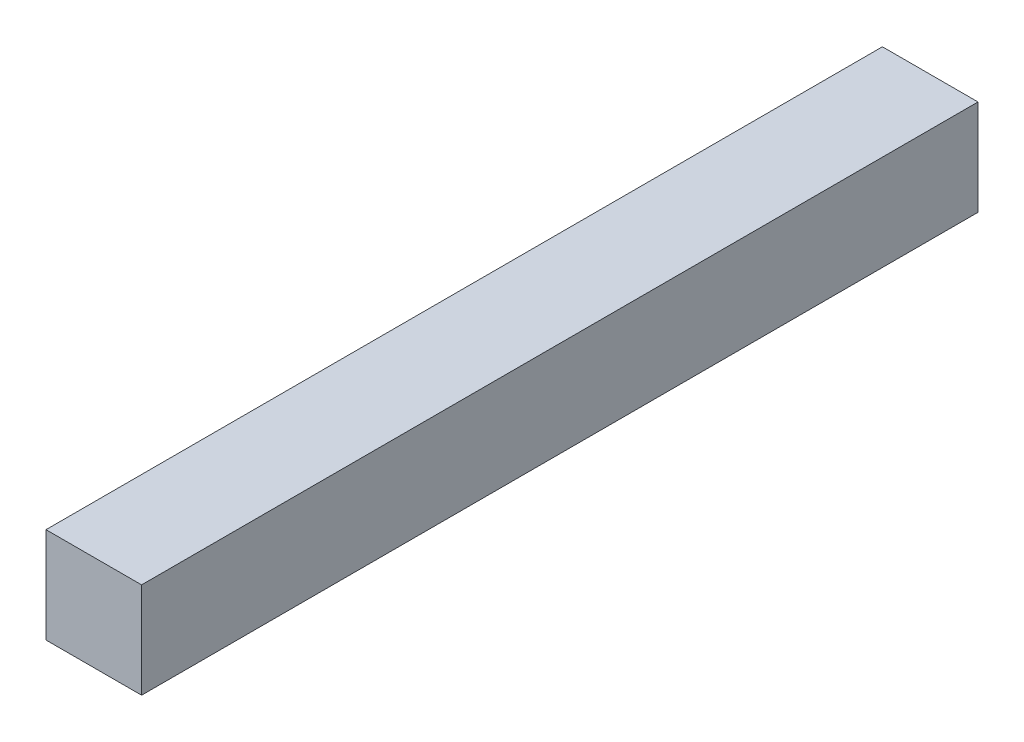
ISO-10303-21;
HEADER;
FILE_DESCRIPTION(('STEP AP214'),'2;1');
FILE_NAME('part.step','',(''),(''),'','','');
FILE_SCHEMA(('AUTOMOTIVE_DESIGN { 1 0 10303 214 1 1 1 1 }'));
ENDSEC;
DATA;
#1=APPLICATION_CONTEXT('core data for automotive mechanical design processes');
#2=APPLICATION_PROTOCOL_DEFINITION('international standard','automotive_design',2000,#1);
#3=PRODUCT_CONTEXT('',#1,'mechanical');
#4=PRODUCT('Part','Part','',(#3));
#5=PRODUCT_RELATED_PRODUCT_CATEGORY('part','',(#4));
#6=PRODUCT_DEFINITION_FORMATION('','',#4);
#7=PRODUCT_DEFINITION_CONTEXT('part definition',#1,'design');
#8=PRODUCT_DEFINITION('design','',#6,#7);
#9=PRODUCT_DEFINITION_SHAPE('','',#8);
#10=(LENGTH_UNIT() NAMED_UNIT(*) SI_UNIT(.MILLI.,.METRE.));
#11=(NAMED_UNIT(*) PLANE_ANGLE_UNIT() SI_UNIT($,.RADIAN.));
#12=(NAMED_UNIT(*) SI_UNIT($,.STERADIAN.) SOLID_ANGLE_UNIT());
#13=UNCERTAINTY_MEASURE_WITH_UNIT(LENGTH_MEASURE(1.E-05),#10,'distance_accuracy_value','');
#14=(GEOMETRIC_REPRESENTATION_CONTEXT(3) GLOBAL_UNCERTAINTY_ASSIGNED_CONTEXT((#13)) GLOBAL_UNIT_ASSIGNED_CONTEXT((#10,
#11,#12)) REPRESENTATION_CONTEXT('',''));
#15=CARTESIAN_POINT('',(0.,0.,0.));
#16=DIRECTION('',(0.,0.,1.));
#17=DIRECTION('',(1.,0.,0.));
#18=AXIS2_PLACEMENT_3D('',#15,#16,#17);
#19=CARTESIAN_POINT('',(-40.,40.,350.));
#20=DIRECTION('',(1.,0.,0.));
#21=DIRECTION('',(0.,1.,0.));
#22=AXIS2_PLACEMENT_3D('',#19,#20,#21);
#23=PLANE('',#22);
#24=DIRECTION('',(0.,-1.,0.));
#25=VECTOR('',#24,1.);
#26=CARTESIAN_POINT('',(-40.,40.,-350.));
#27=LINE('',#26,#25);
#28=CARTESIAN_POINT('',(-40.,40.,-350.));
#29=VERTEX_POINT('',#28);
#30=CARTESIAN_POINT('',(-40.,-40.,-350.));
#31=VERTEX_POINT('',#30);
#32=EDGE_CURVE('E96',#29,#31,#27,.T.);
#33=ORIENTED_EDGE('',*,*,#32,.T.);
#34=DIRECTION('',(0.,0.,-1.));
#35=VECTOR('',#34,1.);
#36=CARTESIAN_POINT('',(-40.,-40.,350.));
#37=LINE('',#36,#35);
#38=CARTESIAN_POINT('',(-40.,-40.,350.));
#39=VERTEX_POINT('',#38);
#40=EDGE_CURVE('E11',#39,#31,#37,.T.);
#41=ORIENTED_EDGE('',*,*,#40,.F.);
#42=DIRECTION('',(0.,-1.,0.));
#43=VECTOR('',#42,1.);
#44=CARTESIAN_POINT('',(-40.,40.,350.));
#45=LINE('',#44,#43);
#46=CARTESIAN_POINT('',(-40.,40.,350.));
#47=VERTEX_POINT('',#46);
#48=EDGE_CURVE('E84',#47,#39,#45,.T.);
#49=ORIENTED_EDGE('',*,*,#48,.F.);
#50=DIRECTION('',(0.,0.,-1.));
#51=VECTOR('',#50,1.);
#52=CARTESIAN_POINT('',(-40.,40.,350.));
#53=LINE('',#52,#51);
#54=EDGE_CURVE('E92',#47,#29,#53,.T.);
#55=ORIENTED_EDGE('',*,*,#54,.T.);
#56=EDGE_LOOP('',(#33,#41,#49,#55));
#57=FACE_BOUND('',#56,.T.);
#58=ADVANCED_FACE('F33',(#57),#23,.F.);
#59=CARTESIAN_POINT('',(40.,-40.,350.));
#60=DIRECTION('',(0.,1.,0.));
#61=DIRECTION('',(-1.,0.,0.));
#62=AXIS2_PLACEMENT_3D('',#59,#60,#61);
#63=PLANE('',#62);
#64=DIRECTION('',(1.,0.,0.));
#65=VECTOR('',#64,1.);
#66=CARTESIAN_POINT('',(40.,-40.,-350.));
#67=LINE('',#66,#65);
#68=CARTESIAN_POINT('',(40.,-40.,-350.));
#69=VERTEX_POINT('',#68);
#70=EDGE_CURVE('E88',#31,#69,#67,.T.);
#71=ORIENTED_EDGE('',*,*,#70,.T.);
#72=DIRECTION('',(0.,0.,-1.));
#73=VECTOR('',#72,1.);
#74=CARTESIAN_POINT('',(40.,-40.,350.));
#75=LINE('',#74,#73);
#76=CARTESIAN_POINT('',(40.,-40.,350.));
#77=VERTEX_POINT('',#76);
#78=EDGE_CURVE('E41',#77,#69,#75,.T.);
#79=ORIENTED_EDGE('',*,*,#78,.F.);
#80=DIRECTION('',(1.,0.,0.));
#81=VECTOR('',#80,1.);
#82=CARTESIAN_POINT('',(40.,-40.,350.));
#83=LINE('',#82,#81);
#84=EDGE_CURVE('E79',#39,#77,#83,.T.);
#85=ORIENTED_EDGE('',*,*,#84,.F.);
#86=ORIENTED_EDGE('',*,*,#40,.T.);
#87=EDGE_LOOP('',(#71,#79,#85,#86));
#88=FACE_BOUND('',#87,.T.);
#89=ADVANCED_FACE('F87',(#88),#63,.F.);
#90=CARTESIAN_POINT('',(40.,40.,350.));
#91=DIRECTION('',(-1.,0.,0.));
#92=DIRECTION('',(0.,-1.,0.));
#93=AXIS2_PLACEMENT_3D('',#90,#91,#92);
#94=PLANE('',#93);
#95=DIRECTION('',(0.,1.,0.));
#96=VECTOR('',#95,1.);
#97=CARTESIAN_POINT('',(40.,40.,-350.));
#98=LINE('',#97,#96);
#99=CARTESIAN_POINT('',(40.,40.,-350.));
#100=VERTEX_POINT('',#99);
#101=EDGE_CURVE('E66',#69,#100,#98,.T.);
#102=ORIENTED_EDGE('',*,*,#101,.T.);
#103=DIRECTION('',(0.,0.,-1.));
#104=VECTOR('',#103,1.);
#105=CARTESIAN_POINT('',(40.,40.,350.));
#106=LINE('',#105,#104);
#107=CARTESIAN_POINT('',(40.,40.,350.));
#108=VERTEX_POINT('',#107);
#109=EDGE_CURVE('E89',#108,#100,#106,.T.);
#110=ORIENTED_EDGE('',*,*,#109,.F.);
#111=DIRECTION('',(0.,1.,0.));
#112=VECTOR('',#111,1.);
#113=CARTESIAN_POINT('',(40.,40.,350.));
#114=LINE('',#113,#112);
#115=EDGE_CURVE('E82',#77,#108,#114,.T.);
#116=ORIENTED_EDGE('',*,*,#115,.F.);
#117=ORIENTED_EDGE('',*,*,#78,.T.);
#118=EDGE_LOOP('',(#102,#110,#116,#117));
#119=FACE_BOUND('',#118,.T.);
#120=ADVANCED_FACE('F90',(#119),#94,.F.);
#121=CARTESIAN_POINT('',(40.,40.,350.));
#122=DIRECTION('',(0.,-1.,0.));
#123=DIRECTION('',(1.,0.,0.));
#124=AXIS2_PLACEMENT_3D('',#121,#122,#123);
#125=PLANE('',#124);
#126=DIRECTION('',(-1.,0.,0.));
#127=VECTOR('',#126,1.);
#128=CARTESIAN_POINT('',(40.,40.,-350.));
#129=LINE('',#128,#127);
#130=EDGE_CURVE('E72',#100,#29,#129,.T.);
#131=ORIENTED_EDGE('',*,*,#130,.T.);
#132=ORIENTED_EDGE('',*,*,#54,.F.);
#133=DIRECTION('',(-1.,0.,0.));
#134=VECTOR('',#133,1.);
#135=CARTESIAN_POINT('',(40.,40.,350.));
#136=LINE('',#135,#134);
#137=EDGE_CURVE('E49',#108,#47,#136,.T.);
#138=ORIENTED_EDGE('',*,*,#137,.F.);
#139=ORIENTED_EDGE('',*,*,#109,.T.);
#140=EDGE_LOOP('',(#131,#132,#138,#139));
#141=FACE_BOUND('',#140,.T.);
#142=ADVANCED_FACE('F104',(#141),#125,.F.);
#143=CARTESIAN_POINT('',(0.,0.,350.));
#144=DIRECTION('',(0.,0.,-1.));
#145=DIRECTION('',(-1.,0.,0.));
#146=AXIS2_PLACEMENT_3D('',#143,#144,#145);
#147=PLANE('',#146);
#148=ORIENTED_EDGE('',*,*,#48,.T.);
#149=ORIENTED_EDGE('',*,*,#84,.T.);
#150=ORIENTED_EDGE('',*,*,#115,.T.);
#151=ORIENTED_EDGE('',*,*,#137,.T.);
#152=EDGE_LOOP('',(#148,#149,#150,#151));
#153=FACE_BOUND('',#152,.T.);
#154=ADVANCED_FACE('F80',(#153),#147,.F.);
#155=CARTESIAN_POINT('',(0.,0.,-350.));
#156=DIRECTION('',(0.,0.,-1.));
#157=DIRECTION('',(-1.,0.,0.));
#158=AXIS2_PLACEMENT_3D('',#155,#156,#157);
#159=PLANE('',#158);
#160=CARTESIAN_POINT('',(0.,0.,-350.));
#161=DIRECTION('',(0.,0.,-1.));
#162=DIRECTION('',(-1.,0.,0.));
#163=AXIS2_PLACEMENT_3D('',#160,#161,#162);
#164=CIRCLE('',#163,30.);
#165=CARTESIAN_POINT('',(-30.,0.,-350.));
#166=VERTEX_POINT('',#165);
#167=EDGE_CURVE('E99',#166,#166,#164,.T.);
#168=ORIENTED_EDGE('',*,*,#167,.F.);
#169=EDGE_LOOP('',(#168));
#170=FACE_BOUND('',#169,.T.);
#171=ORIENTED_EDGE('',*,*,#32,.F.);
#172=ORIENTED_EDGE('',*,*,#130,.F.);
#173=ORIENTED_EDGE('',*,*,#101,.F.);
#174=ORIENTED_EDGE('',*,*,#70,.F.);
#175=EDGE_LOOP('',(#171,#172,#173,#174));
#176=FACE_BOUND('',#175,.T.);
#177=ADVANCED_FACE('F107',(#170,#176),#159,.T.);
#178=CARTESIAN_POINT('',(0.,0.,-340.));
#179=DIRECTION('',(0.,0.,-1.));
#180=DIRECTION('',(-1.,0.,0.));
#181=AXIS2_PLACEMENT_3D('',#178,#179,#180);
#182=CYLINDRICAL_SURFACE('',#181,30.);
#183=CARTESIAN_POINT('',(0.,0.,-340.));
#184=DIRECTION('',(0.,0.,-1.));
#185=DIRECTION('',(-1.,0.,0.));
#186=AXIS2_PLACEMENT_3D('',#183,#184,#185);
#187=CIRCLE('',#186,30.);
#188=CARTESIAN_POINT('',(-30.,0.,-340.));
#189=VERTEX_POINT('',#188);
#190=EDGE_CURVE('E112',#189,#189,#187,.F.);
#191=ORIENTED_EDGE('',*,*,#190,.T.);
#192=EDGE_LOOP('',(#191));
#193=FACE_BOUND('',#192,.T.);
#194=ORIENTED_EDGE('',*,*,#167,.T.);
#195=EDGE_LOOP('',(#194));
#196=FACE_BOUND('',#195,.T.);
#197=ADVANCED_FACE('F133',(#193,#196),#182,.F.);
#198=CARTESIAN_POINT('',(0.,0.,-340.));
#199=DIRECTION('',(0.,0.,-1.));
#200=DIRECTION('',(-1.,0.,0.));
#201=AXIS2_PLACEMENT_3D('',#198,#199,#200);
#202=PLANE('',#201);
#203=CARTESIAN_POINT('',(0.,0.,-340.));
#204=DIRECTION('',(0.,0.,-1.));
#205=DIRECTION('',(-1.,0.,0.));
#206=AXIS2_PLACEMENT_3D('',#203,#204,#205);
#207=CIRCLE('',#206,35.);
#208=CARTESIAN_POINT('',(-35.,0.,-340.));
#209=VERTEX_POINT('',#208);
#210=EDGE_CURVE('E116',#209,#209,#207,.T.);
#211=ORIENTED_EDGE('',*,*,#210,.F.);
#212=EDGE_LOOP('',(#211));
#213=FACE_BOUND('',#212,.T.);
#214=ORIENTED_EDGE('',*,*,#190,.F.);
#215=EDGE_LOOP('',(#214));
#216=FACE_BOUND('',#215,.T.);
#217=ADVANCED_FACE('F127',(#213,#216),#202,.F.);
#218=CARTESIAN_POINT('',(0.,0.,-330.));
#219=DIRECTION('',(0.,0.,-1.));
#220=DIRECTION('',(-1.,0.,0.));
#221=AXIS2_PLACEMENT_3D('',#218,#219,#220);
#222=CYLINDRICAL_SURFACE('',#221,35.);
#223=CARTESIAN_POINT('',(0.,0.,-330.));
#224=DIRECTION('',(0.,0.,-1.));
#225=DIRECTION('',(-1.,0.,0.));
#226=AXIS2_PLACEMENT_3D('',#223,#224,#225);
#227=CIRCLE('',#226,35.);
#228=CARTESIAN_POINT('',(-35.,0.,-330.));
#229=VERTEX_POINT('',#228);
#230=EDGE_CURVE('E115',#229,#229,#227,.T.);
#231=ORIENTED_EDGE('',*,*,#230,.F.);
#232=EDGE_LOOP('',(#231));
#233=FACE_BOUND('',#232,.T.);
#234=ORIENTED_EDGE('',*,*,#210,.T.);
#235=EDGE_LOOP('',(#234));
#236=FACE_BOUND('',#235,.T.);
#237=ADVANCED_FACE('F124',(#233,#236),#222,.F.);
#238=CARTESIAN_POINT('',(0.,0.,-330.));
#239=DIRECTION('',(0.,0.,-1.));
#240=DIRECTION('',(-1.,0.,0.));
#241=AXIS2_PLACEMENT_3D('',#238,#239,#240);
#242=PLANE('',#241);
#243=ORIENTED_EDGE('',*,*,#230,.T.);
#244=EDGE_LOOP('',(#243));
#245=FACE_BOUND('',#244,.T.);
#246=ADVANCED_FACE('F122',(#245),#242,.T.);
#247=CLOSED_SHELL('',(#58,#89,#120,#142,#154,#177,#197,#217,#237,#246));
#248=MANIFOLD_SOLID_BREP('B2',#247);
#249=ADVANCED_BREP_SHAPE_REPRESENTATION('',(#18,#248),#14);
#250=SHAPE_DEFINITION_REPRESENTATION(#9,#249);
ENDSEC;
END-ISO-10303-21;
